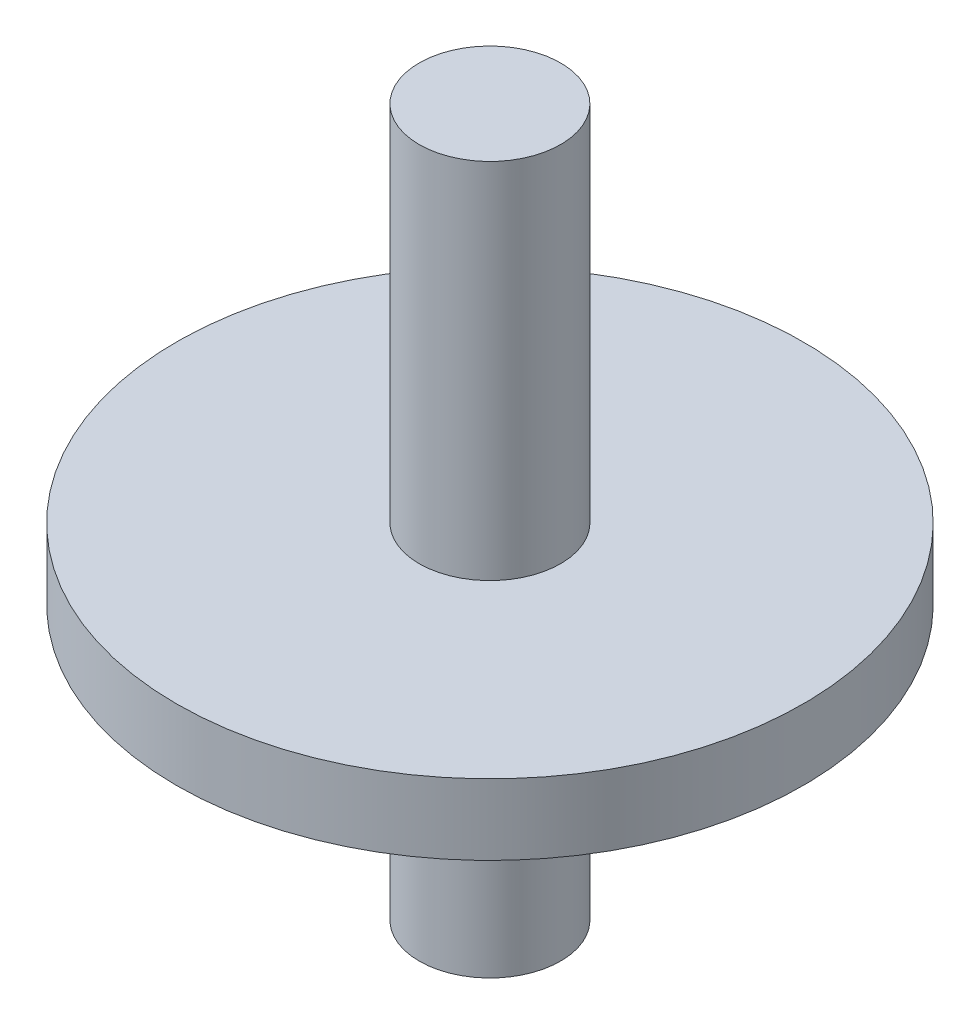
ISO-10303-21;
HEADER;
FILE_DESCRIPTION(('STEP AP214'),'2;1');
FILE_NAME('part.step','',(''),(''),'','','');
FILE_SCHEMA(('AUTOMOTIVE_DESIGN { 1 0 10303 214 1 1 1 1 }'));
ENDSEC;
DATA;
#1=APPLICATION_CONTEXT('core data for automotive mechanical design processes');
#2=APPLICATION_PROTOCOL_DEFINITION('international standard','automotive_design',2000,#1);
#3=PRODUCT_CONTEXT('',#1,'mechanical');
#4=PRODUCT('Part','Part','',(#3));
#5=PRODUCT_RELATED_PRODUCT_CATEGORY('part','',(#4));
#6=PRODUCT_DEFINITION_FORMATION('','',#4);
#7=PRODUCT_DEFINITION_CONTEXT('part definition',#1,'design');
#8=PRODUCT_DEFINITION('design','',#6,#7);
#9=PRODUCT_DEFINITION_SHAPE('','',#8);
#10=(LENGTH_UNIT() NAMED_UNIT(*) SI_UNIT(.MILLI.,.METRE.));
#11=(NAMED_UNIT(*) PLANE_ANGLE_UNIT() SI_UNIT($,.RADIAN.));
#12=(NAMED_UNIT(*) SI_UNIT($,.STERADIAN.) SOLID_ANGLE_UNIT());
#13=UNCERTAINTY_MEASURE_WITH_UNIT(LENGTH_MEASURE(1.E-05),#10,'distance_accuracy_value','');
#14=(GEOMETRIC_REPRESENTATION_CONTEXT(3) GLOBAL_UNCERTAINTY_ASSIGNED_CONTEXT((#13)) GLOBAL_UNIT_ASSIGNED_CONTEXT((#10,
#11,#12)) REPRESENTATION_CONTEXT('',''));
#15=CARTESIAN_POINT('',(0.,0.,0.));
#16=DIRECTION('',(0.,0.,1.));
#17=DIRECTION('',(1.,0.,0.));
#18=AXIS2_PLACEMENT_3D('',#15,#16,#17);
#19=CARTESIAN_POINT('',(12.7,0.,0.));
#20=DIRECTION('',(0.,-1.,0.));
#21=DIRECTION('',(0.,0.,-1.));
#22=AXIS2_PLACEMENT_3D('',#19,#20,#21);
#23=PLANE('',#22);
#24=CARTESIAN_POINT('',(0.,0.,0.));
#25=DIRECTION('',(0.,1.,0.));
#26=DIRECTION('',(0.,0.,1.));
#27=AXIS2_PLACEMENT_3D('',#24,#25,#26);
#28=CIRCLE('',#27,12.7);
#29=CARTESIAN_POINT('',(0.,0.,12.7));
#30=VERTEX_POINT('',#29);
#31=EDGE_CURVE('E53',#30,#30,#28,.T.);
#32=ORIENTED_EDGE('',*,*,#31,.F.);
#33=EDGE_LOOP('',(#32));
#34=FACE_BOUND('',#33,.T.);
#35=ADVANCED_FACE('F31',(#34),#23,.T.);
#36=CARTESIAN_POINT('',(12.7,127.,0.));
#37=DIRECTION('',(0.,-1.,0.));
#38=DIRECTION('',(0.,0.,-1.));
#39=AXIS2_PLACEMENT_3D('',#36,#37,#38);
#40=PLANE('',#39);
#41=CARTESIAN_POINT('',(0.,127.,0.));
#42=DIRECTION('',(0.,1.,0.));
#43=DIRECTION('',(0.,0.,1.));
#44=AXIS2_PLACEMENT_3D('',#41,#42,#43);
#45=CIRCLE('',#44,12.7);
#46=CARTESIAN_POINT('',(0.,127.,12.7));
#47=VERTEX_POINT('',#46);
#48=EDGE_CURVE('E10',#47,#47,#45,.T.);
#49=ORIENTED_EDGE('',*,*,#48,.T.);
#50=EDGE_LOOP('',(#49));
#51=FACE_BOUND('',#50,.T.);
#52=ADVANCED_FACE('F60',(#51),#40,.F.);
#53=CARTESIAN_POINT('',(0.,92.6609442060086,0.));
#54=DIRECTION('',(0.,1.,0.));
#55=DIRECTION('',(0.,0.,1.));
#56=AXIS2_PLACEMENT_3D('',#53,#54,#55);
#57=CYLINDRICAL_SURFACE('',#56,12.7);
#58=ORIENTED_EDGE('',*,*,#48,.F.);
#59=EDGE_LOOP('',(#58));
#60=FACE_BOUND('',#59,.T.);
#61=CARTESIAN_POINT('',(0.,61.8103004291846,0.));
#62=DIRECTION('',(0.,1.,0.));
#63=DIRECTION('',(0.,0.,1.));
#64=AXIS2_PLACEMENT_3D('',#61,#62,#63);
#65=CIRCLE('',#64,12.7);
#66=CARTESIAN_POINT('',(0.,61.8103004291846,12.7));
#67=VERTEX_POINT('',#66);
#68=EDGE_CURVE('E37',#67,#67,#65,.T.);
#69=ORIENTED_EDGE('',*,*,#68,.T.);
#70=EDGE_LOOP('',(#69));
#71=FACE_BOUND('',#70,.T.);
#72=ADVANCED_FACE('F64',(#60,#71),#57,.T.);
#73=CARTESIAN_POINT('',(56.2915236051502,61.8103004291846,0.));
#74=DIRECTION('',(0.,-1.,0.));
#75=DIRECTION('',(0.,0.,-1.));
#76=AXIS2_PLACEMENT_3D('',#73,#74,#75);
#77=PLANE('',#76);
#78=ORIENTED_EDGE('',*,*,#68,.F.);
#79=EDGE_LOOP('',(#78));
#80=FACE_BOUND('',#79,.T.);
#81=CARTESIAN_POINT('',(0.,61.8103004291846,0.));
#82=DIRECTION('',(0.,1.,0.));
#83=DIRECTION('',(0.,0.,1.));
#84=AXIS2_PLACEMENT_3D('',#81,#82,#83);
#85=CIRCLE('',#84,56.2915236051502);
#86=CARTESIAN_POINT('',(0.,61.8103004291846,56.2915236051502));
#87=VERTEX_POINT('',#86);
#88=EDGE_CURVE('E41',#87,#87,#85,.T.);
#89=ORIENTED_EDGE('',*,*,#88,.T.);
#90=EDGE_LOOP('',(#89));
#91=FACE_BOUND('',#90,.T.);
#92=ADVANCED_FACE('F68',(#80,#91),#77,.F.);
#93=CARTESIAN_POINT('',(0.,92.6609442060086,0.));
#94=DIRECTION('',(0.,1.,0.));
#95=DIRECTION('',(0.,0.,1.));
#96=AXIS2_PLACEMENT_3D('',#93,#94,#95);
#97=CYLINDRICAL_SURFACE('',#96,56.2915236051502);
#98=ORIENTED_EDGE('',*,*,#88,.F.);
#99=EDGE_LOOP('',(#98));
#100=FACE_BOUND('',#99,.T.);
#101=CARTESIAN_POINT('',(0.,49.1103004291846,0.));
#102=DIRECTION('',(0.,1.,0.));
#103=DIRECTION('',(0.,0.,1.));
#104=AXIS2_PLACEMENT_3D('',#101,#102,#103);
#105=CIRCLE('',#104,56.2915236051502);
#106=CARTESIAN_POINT('',(0.,49.1103004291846,56.2915236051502));
#107=VERTEX_POINT('',#106);
#108=EDGE_CURVE('E45',#107,#107,#105,.T.);
#109=ORIENTED_EDGE('',*,*,#108,.T.);
#110=EDGE_LOOP('',(#109));
#111=FACE_BOUND('',#110,.T.);
#112=ADVANCED_FACE('F74',(#100,#111),#97,.T.);
#113=CARTESIAN_POINT('',(12.7,49.1103004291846,0.));
#114=DIRECTION('',(0.,1.,0.));
#115=DIRECTION('',(0.,0.,1.));
#116=AXIS2_PLACEMENT_3D('',#113,#114,#115);
#117=PLANE('',#116);
#118=ORIENTED_EDGE('',*,*,#108,.F.);
#119=EDGE_LOOP('',(#118));
#120=FACE_BOUND('',#119,.T.);
#121=CARTESIAN_POINT('',(0.,49.1103004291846,0.));
#122=DIRECTION('',(0.,1.,0.));
#123=DIRECTION('',(0.,0.,1.));
#124=AXIS2_PLACEMENT_3D('',#121,#122,#123);
#125=CIRCLE('',#124,12.7);
#126=CARTESIAN_POINT('',(0.,49.1103004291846,12.7));
#127=VERTEX_POINT('',#126);
#128=EDGE_CURVE('E50',#127,#127,#125,.T.);
#129=ORIENTED_EDGE('',*,*,#128,.T.);
#130=EDGE_LOOP('',(#129));
#131=FACE_BOUND('',#130,.T.);
#132=ADVANCED_FACE('F78',(#120,#131),#117,.F.);
#133=CARTESIAN_POINT('',(0.,92.6609442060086,0.));
#134=DIRECTION('',(0.,1.,0.));
#135=DIRECTION('',(0.,0.,1.));
#136=AXIS2_PLACEMENT_3D('',#133,#134,#135);
#137=CYLINDRICAL_SURFACE('',#136,12.7);
#138=ORIENTED_EDGE('',*,*,#128,.F.);
#139=EDGE_LOOP('',(#138));
#140=FACE_BOUND('',#139,.T.);
#141=ORIENTED_EDGE('',*,*,#31,.T.);
#142=EDGE_LOOP('',(#141));
#143=FACE_BOUND('',#142,.T.);
#144=ADVANCED_FACE('F57',(#140,#143),#137,.T.);
#145=CLOSED_SHELL('',(#35,#52,#72,#92,#112,#132,#144));
#146=MANIFOLD_SOLID_BREP('B2',#145);
#147=ADVANCED_BREP_SHAPE_REPRESENTATION('',(#18,#146),#14);
#148=SHAPE_DEFINITION_REPRESENTATION(#9,#147);
ENDSEC;
END-ISO-10303-21;
